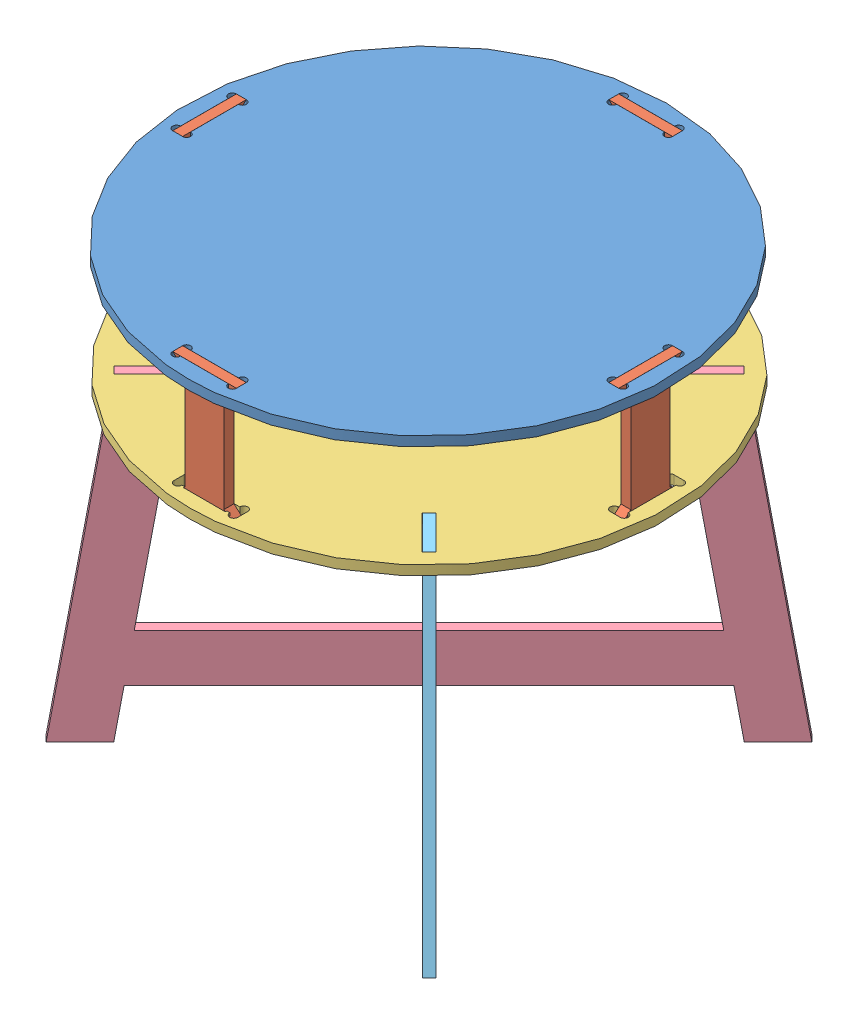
SolidWorks assembly Assem2.SLDASM, configuration Default (file format 11000). Lengths in mm.
Overall size (600.05 541.2 601.85).
8 component instances, 5 part files, 21 mates.
Components (placement in the parent):
- bottom-1: bottom.SLDPRT [Default] at (174.8177 340.8238 463.5824) size (600 12 600)
- lock-4: lock.SLDPRT [Default] at (175.0181 276.2238 183.6324) x (-1 0 0) z (0 1 0) size (80 12.5 153.2)
- top-1: top.SLDPRT [Default] at (174.7677 199.6238 461.7278) size (600 12 600)
- L1-9: L1.SLDPRT [Default] at (-6.2646 11.6238 633.9213) x (0.707107 0 -0.707107) z (0 -1 0) size (679.54 12 400)
- lock-12: lock.SLDPRT [Default] at (-105.1323 276.2238 463.382) x (0 0 1) z (0 1 0) size (80 12.5 153.2)
- lock-13: lock.SLDPRT [Default] at (174.6173 276.2238 743.5324) x (1 0 0) z (0 1 0) size (80 12.5 153.2)
- lock-14: lock.SLDPRT [Default] at (454.7677 276.2238 463.7828) x (0 0 -1) z (0 1 0) size (80 12.5 153.2)
- L2-1: L2.SLDPRT [Default] at (364.8994 30.9334 659.9913) x (-0.707107 0 -0.707107) z (0 -1 0) size (760.88 12 391.75)
Mates (geometry in assembly coordinates):
- Coincident29: coincident: line of top-1 through (23.7874 211.6238 621.5469) axis (-0.707107 0 -0.707107); line of L1-9 through (23.4339 211.6238 621.1934) axis (-0.707107 0 -0.707107)
- Coincident30: coincident: line of top-1 through (14.9486 211.6238 612.7081) axis (-0.707107 0 0.707107); line of L1-9 through (14.9486 211.6238 612.7081) axis (-0.707107 0 0.707107)
- Coincident32: coincident: line of top-1 through (377.0132 211.6238 655.1345) axis (-0.707107 0 -0.707107); line of L2-1 through (334.5868 211.6238 612.7081) axis (0.707107 0 0.707107)
- Coincident34: coincident: line of top-1 through (368.1743 211.6238 663.9733) axis (0.707107 0 -0.707107); line of L2-1 through (377.0132 211.6238 655.1345) axis (-0.707107 0 0.707107)
- Lock1: lock: unknown of top-1; unknown of lock-12
- Lock2: lock: unknown of bottom-1; unknown of lock-12
- Lock3: lock: unknown of bottom-1; unknown of lock-13
- Lock4: lock: unknown of top-1; unknown of lock-13
- Lock5: lock: unknown of top-1; unknown of lock-14
- Lock6: lock: unknown of bottom-1; unknown of lock-14
- Lock7: lock: unknown of top-1; unknown of L2-1
- Lock8: lock: unknown of top-1; unknown of L1-9
- Lock9: lock: unknown of top-1; unknown of L2-1
- Lock10: lock: unknown of top-1; unknown of lock-12
- Lock11: lock: unknown of top-1; unknown of lock-13
- Lock12: lock: unknown of top-1; unknown of lock-14
- Lock13: lock: unknown of bottom-1; unknown of lock-12
- Lock14: lock: unknown of bottom-1; unknown of lock-13
- Lock15: lock: unknown of bottom-1; unknown of lock-14
- Lock16: lock: unknown of lock-4; unknown of top-1
- Lock17: lock: unknown of bottom-1; unknown of lock-4
